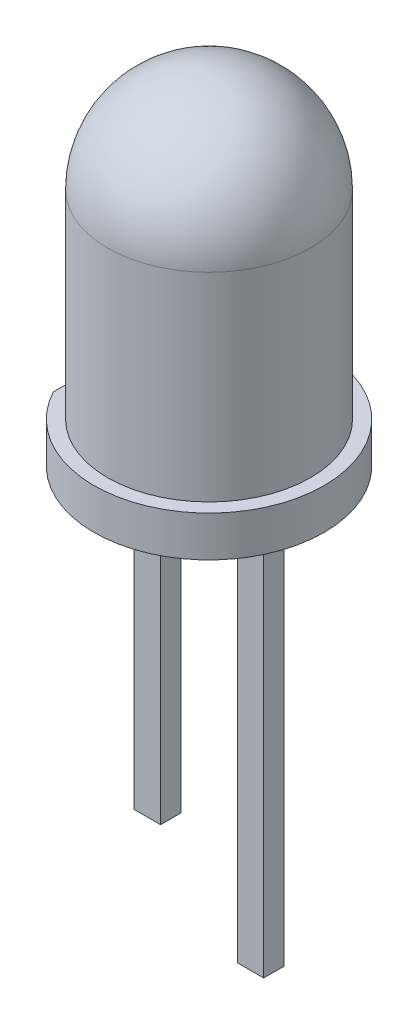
ISO-10303-21;
HEADER;
FILE_DESCRIPTION(('STEP AP214'),'2;1');
FILE_NAME('part.step','',(''),(''),'','','');
FILE_SCHEMA(('AUTOMOTIVE_DESIGN { 1 0 10303 214 1 1 1 1 }'));
ENDSEC;
DATA;
#1=APPLICATION_CONTEXT('core data for automotive mechanical design processes');
#2=APPLICATION_PROTOCOL_DEFINITION('international standard','automotive_design',2000,#1);
#3=PRODUCT_CONTEXT('',#1,'mechanical');
#4=PRODUCT('Part','Part','',(#3));
#5=PRODUCT_RELATED_PRODUCT_CATEGORY('part','',(#4));
#6=PRODUCT_DEFINITION_FORMATION('','',#4);
#7=PRODUCT_DEFINITION_CONTEXT('part definition',#1,'design');
#8=PRODUCT_DEFINITION('design','',#6,#7);
#9=PRODUCT_DEFINITION_SHAPE('','',#8);
#10=(LENGTH_UNIT() NAMED_UNIT(*) SI_UNIT(.MILLI.,.METRE.));
#11=(NAMED_UNIT(*) PLANE_ANGLE_UNIT() SI_UNIT($,.RADIAN.));
#12=(NAMED_UNIT(*) SI_UNIT($,.STERADIAN.) SOLID_ANGLE_UNIT());
#13=UNCERTAINTY_MEASURE_WITH_UNIT(LENGTH_MEASURE(1.E-05),#10,'distance_accuracy_value','');
#14=(GEOMETRIC_REPRESENTATION_CONTEXT(3) GLOBAL_UNCERTAINTY_ASSIGNED_CONTEXT((#13)) GLOBAL_UNIT_ASSIGNED_CONTEXT((#10,
#11,#12)) REPRESENTATION_CONTEXT('',''));
#15=CARTESIAN_POINT('',(0.,0.,0.));
#16=DIRECTION('',(0.,0.,1.));
#17=DIRECTION('',(1.,0.,0.));
#18=AXIS2_PLACEMENT_3D('',#15,#16,#17);
#19=CARTESIAN_POINT('',(-1.595,0.,0.25));
#20=DIRECTION('',(0.,1.,0.));
#21=DIRECTION('',(0.,0.,1.));
#22=AXIS2_PLACEMENT_3D('',#19,#20,#21);
#23=PLANE('',#22);
#24=DIRECTION('',(1.,0.,0.));
#25=VECTOR('',#24,1.);
#26=CARTESIAN_POINT('',(-1.595,0.,-0.25));
#27=LINE('',#26,#25);
#28=CARTESIAN_POINT('',(-1.595,0.,-0.25));
#29=VERTEX_POINT('',#28);
#30=CARTESIAN_POINT('',(-0.945,0.,-0.25));
#31=VERTEX_POINT('',#30);
#32=EDGE_CURVE('E87',#29,#31,#27,.T.);
#33=ORIENTED_EDGE('',*,*,#32,.T.);
#34=DIRECTION('',(0.,0.,-1.));
#35=VECTOR('',#34,1.);
#36=CARTESIAN_POINT('',(-0.945,0.,0.25));
#37=LINE('',#36,#35);
#38=CARTESIAN_POINT('',(-0.945,0.,0.25));
#39=VERTEX_POINT('',#38);
#40=EDGE_CURVE('E12',#39,#31,#37,.T.);
#41=ORIENTED_EDGE('',*,*,#40,.F.);
#42=DIRECTION('',(1.,0.,0.));
#43=VECTOR('',#42,1.);
#44=CARTESIAN_POINT('',(-1.595,0.,0.25));
#45=LINE('',#44,#43);
#46=CARTESIAN_POINT('',(-1.595,0.,0.25));
#47=VERTEX_POINT('',#46);
#48=EDGE_CURVE('E108',#47,#39,#45,.T.);
#49=ORIENTED_EDGE('',*,*,#48,.F.);
#50=DIRECTION('',(0.,0.,-1.));
#51=VECTOR('',#50,1.);
#52=CARTESIAN_POINT('',(-1.595,0.,0.25));
#53=LINE('',#52,#51);
#54=EDGE_CURVE('E100',#47,#29,#53,.T.);
#55=ORIENTED_EDGE('',*,*,#54,.T.);
#56=EDGE_LOOP('',(#33,#41,#49,#55));
#57=FACE_BOUND('',#56,.T.);
#58=ADVANCED_FACE('F37',(#57),#23,.F.);
#59=CARTESIAN_POINT('',(-0.945,0.,0.25));
#60=DIRECTION('',(-1.,0.,0.));
#61=DIRECTION('',(0.,0.,1.));
#62=AXIS2_PLACEMENT_3D('',#59,#60,#61);
#63=PLANE('',#62);
#64=DIRECTION('',(0.,1.,0.));
#65=VECTOR('',#64,1.);
#66=CARTESIAN_POINT('',(-0.945,0.,-0.25));
#67=LINE('',#66,#65);
#68=CARTESIAN_POINT('',(-0.945,0.271653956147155,-0.25));
#69=VERTEX_POINT('',#68);
#70=EDGE_CURVE('E83',#31,#69,#67,.T.);
#71=ORIENTED_EDGE('',*,*,#70,.T.);
#72=DIRECTION('',(0.,0.,-1.));
#73=VECTOR('',#72,1.);
#74=CARTESIAN_POINT('',(-0.945,0.271653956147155,0.25));
#75=LINE('',#74,#73);
#76=CARTESIAN_POINT('',(-0.945,0.271653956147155,0.25));
#77=VERTEX_POINT('',#76);
#78=EDGE_CURVE('E44',#77,#69,#75,.T.);
#79=ORIENTED_EDGE('',*,*,#78,.F.);
#80=DIRECTION('',(0.,1.,0.));
#81=VECTOR('',#80,1.);
#82=CARTESIAN_POINT('',(-0.945,0.,0.25));
#83=LINE('',#82,#81);
#84=EDGE_CURVE('E96',#39,#77,#83,.T.);
#85=ORIENTED_EDGE('',*,*,#84,.F.);
#86=ORIENTED_EDGE('',*,*,#40,.T.);
#87=EDGE_LOOP('',(#71,#79,#85,#86));
#88=FACE_BOUND('',#87,.T.);
#89=ADVANCED_FACE('F95',(#88),#63,.F.);
#90=CARTESIAN_POINT('',(-0.945,0.271653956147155,0.25));
#91=DIRECTION('',(-0.485529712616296,0.874220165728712,0.));
#92=DIRECTION('',(-0.874220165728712,-0.485529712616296,0.));
#93=AXIS2_PLACEMENT_3D('',#90,#91,#92);
#94=PLANE('',#93);
#95=DIRECTION('',(0.874220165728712,0.485529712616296,0.));
#96=VECTOR('',#95,1.);
#97=CARTESIAN_POINT('',(-0.945,0.271653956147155,-0.25));
#98=LINE('',#97,#96);
#99=CARTESIAN_POINT('',(-0.32399866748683,0.616549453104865,-0.25));
#100=VERTEX_POINT('',#99);
#101=EDGE_CURVE('E89',#69,#100,#98,.T.);
#102=ORIENTED_EDGE('',*,*,#101,.T.);
#103=DIRECTION('',(0.,0.,-1.));
#104=VECTOR('',#103,1.);
#105=CARTESIAN_POINT('',(-0.32399866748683,0.616549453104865,0.25));
#106=LINE('',#105,#104);
#107=CARTESIAN_POINT('',(-0.32399866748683,0.616549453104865,0.25));
#108=VERTEX_POINT('',#107);
#109=EDGE_CURVE('E119',#108,#100,#106,.T.);
#110=ORIENTED_EDGE('',*,*,#109,.F.);
#111=DIRECTION('',(0.874220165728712,0.485529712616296,0.));
#112=VECTOR('',#111,1.);
#113=CARTESIAN_POINT('',(-0.945,0.271653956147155,0.25));
#114=LINE('',#113,#112);
#115=EDGE_CURVE('E111',#77,#108,#114,.T.);
#116=ORIENTED_EDGE('',*,*,#115,.F.);
#117=ORIENTED_EDGE('',*,*,#78,.T.);
#118=EDGE_LOOP('',(#102,#110,#116,#117));
#119=FACE_BOUND('',#118,.T.);
#120=ADVANCED_FACE('F123',(#119),#94,.F.);
#121=CARTESIAN_POINT('',(-1.595,3.29327204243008,0.25));
#122=DIRECTION('',(-0.9033352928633,-0.428935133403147,0.));
#123=DIRECTION('',(0.428935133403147,-0.9033352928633,0.));
#124=AXIS2_PLACEMENT_3D('',#121,#122,#123);
#125=PLANE('',#124);
#126=DIRECTION('',(-0.428935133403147,0.9033352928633,0.));
#127=VECTOR('',#126,1.);
#128=CARTESIAN_POINT('',(-1.595,3.29327204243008,-0.25));
#129=LINE('',#128,#127);
#130=CARTESIAN_POINT('',(-1.595,3.29327204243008,-0.25));
#131=VERTEX_POINT('',#130);
#132=EDGE_CURVE('E104',#100,#131,#129,.T.);
#133=ORIENTED_EDGE('',*,*,#132,.T.);
#134=DIRECTION('',(0.,0.,-1.));
#135=VECTOR('',#134,1.);
#136=CARTESIAN_POINT('',(-1.595,3.29327204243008,0.25));
#137=LINE('',#136,#135);
#138=CARTESIAN_POINT('',(-1.595,3.29327204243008,0.25));
#139=VERTEX_POINT('',#138);
#140=EDGE_CURVE('E116',#139,#131,#137,.T.);
#141=ORIENTED_EDGE('',*,*,#140,.F.);
#142=DIRECTION('',(-0.428935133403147,0.9033352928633,0.));
#143=VECTOR('',#142,1.);
#144=CARTESIAN_POINT('',(-1.595,3.29327204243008,0.25));
#145=LINE('',#144,#143);
#146=EDGE_CURVE('E56',#108,#139,#145,.T.);
#147=ORIENTED_EDGE('',*,*,#146,.F.);
#148=ORIENTED_EDGE('',*,*,#109,.T.);
#149=EDGE_LOOP('',(#133,#141,#147,#148));
#150=FACE_BOUND('',#149,.T.);
#151=ADVANCED_FACE('F134',(#150),#125,.F.);
#152=CARTESIAN_POINT('',(-1.595,0.,0.25));
#153=DIRECTION('',(1.,0.,0.));
#154=DIRECTION('',(0.,0.,-1.));
#155=AXIS2_PLACEMENT_3D('',#152,#153,#154);
#156=PLANE('',#155);
#157=DIRECTION('',(0.,-1.,0.));
#158=VECTOR('',#157,1.);
#159=CARTESIAN_POINT('',(-1.595,0.,-0.25));
#160=LINE('',#159,#158);
#161=EDGE_CURVE('E106',#131,#29,#160,.T.);
#162=ORIENTED_EDGE('',*,*,#161,.T.);
#163=ORIENTED_EDGE('',*,*,#54,.F.);
#164=DIRECTION('',(0.,-1.,0.));
#165=VECTOR('',#164,1.);
#166=CARTESIAN_POINT('',(-1.595,0.,0.25));
#167=LINE('',#166,#165);
#168=EDGE_CURVE('E51',#139,#47,#167,.T.);
#169=ORIENTED_EDGE('',*,*,#168,.F.);
#170=ORIENTED_EDGE('',*,*,#140,.T.);
#171=EDGE_LOOP('',(#162,#163,#169,#170));
#172=FACE_BOUND('',#171,.T.);
#173=ADVANCED_FACE('F127',(#172),#156,.F.);
#174=CARTESIAN_POINT('',(-0.945,0.,0.25));
#175=DIRECTION('',(0.,0.,1.));
#176=DIRECTION('',(1.,0.,0.));
#177=AXIS2_PLACEMENT_3D('',#174,#175,#176);
#178=PLANE('',#177);
#179=ORIENTED_EDGE('',*,*,#48,.T.);
#180=ORIENTED_EDGE('',*,*,#84,.T.);
#181=ORIENTED_EDGE('',*,*,#115,.T.);
#182=ORIENTED_EDGE('',*,*,#146,.T.);
#183=ORIENTED_EDGE('',*,*,#168,.T.);
#184=EDGE_LOOP('',(#179,#180,#181,#182,#183));
#185=FACE_BOUND('',#184,.T.);
#186=ADVANCED_FACE('F125',(#185),#178,.T.);
#187=CARTESIAN_POINT('',(-0.945,0.,-0.25));
#188=DIRECTION('',(0.,0.,1.));
#189=DIRECTION('',(1.,0.,0.));
#190=AXIS2_PLACEMENT_3D('',#187,#188,#189);
#191=PLANE('',#190);
#192=ORIENTED_EDGE('',*,*,#32,.F.);
#193=ORIENTED_EDGE('',*,*,#161,.F.);
#194=ORIENTED_EDGE('',*,*,#132,.F.);
#195=ORIENTED_EDGE('',*,*,#101,.F.);
#196=ORIENTED_EDGE('',*,*,#70,.F.);
#197=EDGE_LOOP('',(#192,#193,#194,#195,#196));
#198=FACE_BOUND('',#197,.T.);
#199=ADVANCED_FACE('F84',(#198),#191,.F.);
#200=CLOSED_SHELL('',(#58,#89,#120,#151,#173,#186,#199));
#201=MANIFOLD_SOLID_BREP('B2',#200);
#202=CARTESIAN_POINT('',(1.595,0.,0.25));
#203=DIRECTION('',(0.,1.,0.));
#204=DIRECTION('',(0.,0.,1.));
#205=AXIS2_PLACEMENT_3D('',#202,#203,#204);
#206=PLANE('',#205);
#207=DIRECTION('',(1.,0.,0.));
#208=VECTOR('',#207,1.);
#209=CARTESIAN_POINT('',(1.595,0.,-0.25));
#210=LINE('',#209,#208);
#211=CARTESIAN_POINT('',(0.945,0.,-0.25));
#212=VERTEX_POINT('',#211);
#213=CARTESIAN_POINT('',(1.595,0.,-0.25));
#214=VERTEX_POINT('',#213);
#215=EDGE_CURVE('E255',#212,#214,#210,.T.);
#216=ORIENTED_EDGE('',*,*,#215,.T.);
#217=DIRECTION('',(0.,0.,-1.));
#218=VECTOR('',#217,1.);
#219=CARTESIAN_POINT('',(1.595,0.,0.25));
#220=LINE('',#219,#218);
#221=CARTESIAN_POINT('',(1.595,0.,0.25));
#222=VERTEX_POINT('',#221);
#223=EDGE_CURVE('E35',#222,#214,#220,.T.);
#224=ORIENTED_EDGE('',*,*,#223,.F.);
#225=DIRECTION('',(1.,0.,0.));
#226=VECTOR('',#225,1.);
#227=CARTESIAN_POINT('',(1.595,0.,0.25));
#228=LINE('',#227,#226);
#229=CARTESIAN_POINT('',(0.945,0.,0.25));
#230=VERTEX_POINT('',#229);
#231=EDGE_CURVE('E284',#230,#222,#228,.T.);
#232=ORIENTED_EDGE('',*,*,#231,.F.);
#233=DIRECTION('',(0.,0.,-1.));
#234=VECTOR('',#233,1.);
#235=CARTESIAN_POINT('',(0.945,0.,0.25));
#236=LINE('',#235,#234);
#237=EDGE_CURVE('E268',#230,#212,#236,.T.);
#238=ORIENTED_EDGE('',*,*,#237,.T.);
#239=EDGE_LOOP('',(#216,#224,#232,#238));
#240=FACE_BOUND('',#239,.T.);
#241=ADVANCED_FACE('F181',(#240),#206,.F.);
#242=CARTESIAN_POINT('',(1.595,0.,0.25));
#243=DIRECTION('',(-1.,0.,0.));
#244=DIRECTION('',(0.,-1.,0.));
#245=AXIS2_PLACEMENT_3D('',#242,#243,#244);
#246=PLANE('',#245);
#247=DIRECTION('',(0.,1.,0.));
#248=VECTOR('',#247,1.);
#249=CARTESIAN_POINT('',(1.595,0.,-0.25));
#250=LINE('',#249,#248);
#251=CARTESIAN_POINT('',(1.595,3.5,-0.25));
#252=VERTEX_POINT('',#251);
#253=EDGE_CURVE('E251',#214,#252,#250,.T.);
#254=ORIENTED_EDGE('',*,*,#253,.T.);
#255=DIRECTION('',(0.,0.,-1.));
#256=VECTOR('',#255,1.);
#257=CARTESIAN_POINT('',(1.595,3.5,0.25));
#258=LINE('',#257,#256);
#259=CARTESIAN_POINT('',(1.595,3.5,0.25));
#260=VERTEX_POINT('',#259);
#261=EDGE_CURVE('E188',#260,#252,#258,.T.);
#262=ORIENTED_EDGE('',*,*,#261,.F.);
#263=DIRECTION('',(0.,1.,0.));
#264=VECTOR('',#263,1.);
#265=CARTESIAN_POINT('',(1.595,0.,0.25));
#266=LINE('',#265,#264);
#267=EDGE_CURVE('E264',#222,#260,#266,.T.);
#268=ORIENTED_EDGE('',*,*,#267,.F.);
#269=ORIENTED_EDGE('',*,*,#223,.T.);
#270=EDGE_LOOP('',(#254,#262,#268,#269));
#271=FACE_BOUND('',#270,.T.);
#272=ADVANCED_FACE('F263',(#271),#246,.F.);
#273=CARTESIAN_POINT('',(1.595,3.5,0.25));
#274=DIRECTION('',(0.,-1.,0.));
#275=DIRECTION('',(0.,0.,-1.));
#276=AXIS2_PLACEMENT_3D('',#273,#274,#275);
#277=PLANE('',#276);
#278=DIRECTION('',(-1.,0.,0.));
#279=VECTOR('',#278,1.);
#280=CARTESIAN_POINT('',(1.595,3.5,-0.25));
#281=LINE('',#280,#279);
#282=CARTESIAN_POINT('',(0.80632764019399,3.5,-0.25));
#283=VERTEX_POINT('',#282);
#284=EDGE_CURVE('E257',#252,#283,#281,.T.);
#285=ORIENTED_EDGE('',*,*,#284,.T.);
#286=DIRECTION('',(0.,0.,-1.));
#287=VECTOR('',#286,1.);
#288=CARTESIAN_POINT('',(0.80632764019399,3.5,0.25));
#289=LINE('',#288,#287);
#290=CARTESIAN_POINT('',(0.80632764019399,3.5,0.25));
#291=VERTEX_POINT('',#290);
#292=EDGE_CURVE('E315',#291,#283,#289,.T.);
#293=ORIENTED_EDGE('',*,*,#292,.F.);
#294=DIRECTION('',(-1.,0.,0.));
#295=VECTOR('',#294,1.);
#296=CARTESIAN_POINT('',(1.595,3.5,0.25));
#297=LINE('',#296,#295);
#298=EDGE_CURVE('E287',#260,#291,#297,.T.);
#299=ORIENTED_EDGE('',*,*,#298,.F.);
#300=ORIENTED_EDGE('',*,*,#261,.T.);
#301=EDGE_LOOP('',(#285,#293,#299,#300));
#302=FACE_BOUND('',#301,.T.);
#303=ADVANCED_FACE('F319',(#302),#277,.F.);
#304=CARTESIAN_POINT('',(0.80632764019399,3.5,0.25));
#305=DIRECTION('',(0.796529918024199,-0.604599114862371,0.));
#306=DIRECTION('',(0.604599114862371,0.796529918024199,0.));
#307=AXIS2_PLACEMENT_3D('',#304,#305,#306);
#308=PLANE('',#307);
#309=DIRECTION('',(-0.604599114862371,-0.796529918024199,0.));
#310=VECTOR('',#309,1.);
#311=CARTESIAN_POINT('',(0.80632764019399,3.5,-0.25));
#312=LINE('',#311,#310);
#313=CARTESIAN_POINT('',(0.521534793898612,3.12479928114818,-0.25));
#314=VERTEX_POINT('',#313);
#315=EDGE_CURVE('E272',#283,#314,#312,.T.);
#316=ORIENTED_EDGE('',*,*,#315,.T.);
#317=DIRECTION('',(0.,0.,-1.));
#318=VECTOR('',#317,1.);
#319=CARTESIAN_POINT('',(0.521534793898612,3.12479928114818,0.25));
#320=LINE('',#319,#318);
#321=CARTESIAN_POINT('',(0.521534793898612,3.12479928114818,0.25));
#322=VERTEX_POINT('',#321);
#323=EDGE_CURVE('E312',#322,#314,#320,.T.);
#324=ORIENTED_EDGE('',*,*,#323,.F.);
#325=DIRECTION('',(-0.604599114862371,-0.796529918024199,0.));
#326=VECTOR('',#325,1.);
#327=CARTESIAN_POINT('',(0.80632764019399,3.5,0.25));
#328=LINE('',#327,#326);
#329=EDGE_CURVE('E289',#291,#322,#328,.T.);
#330=ORIENTED_EDGE('',*,*,#329,.F.);
#331=ORIENTED_EDGE('',*,*,#292,.T.);
#332=EDGE_LOOP('',(#316,#324,#330,#331));
#333=FACE_BOUND('',#332,.T.);
#334=ADVANCED_FACE('F327',(#333),#308,.F.);
#335=CARTESIAN_POINT('',(0.123269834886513,3.42709883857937,0.25));
#336=DIRECTION('',(0.,0.,-1.));
#337=DIRECTION('',(-1.,0.,0.));
#338=AXIS2_PLACEMENT_3D('',#335,#336,#337);
#339=CYLINDRICAL_SURFACE('',#338,0.5);
#340=CARTESIAN_POINT('',(0.123269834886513,3.42709883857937,-0.25));
#341=DIRECTION('',(0.,0.,-1.));
#342=DIRECTION('',(1.,0.,0.));
#343=AXIS2_PLACEMENT_3D('',#340,#341,#342);
#344=CIRCLE('',#343,0.5);
#345=CARTESIAN_POINT('',(-0.103725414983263,2.98159557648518,-0.25));
#346=VERTEX_POINT('',#345);
#347=EDGE_CURVE('E274',#314,#346,#344,.T.);
#348=ORIENTED_EDGE('',*,*,#347,.T.);
#349=DIRECTION('',(0.,0.,-1.));
#350=VECTOR('',#349,1.);
#351=CARTESIAN_POINT('',(-0.103725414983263,2.98159557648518,0.25));
#352=LINE('',#351,#350);
#353=CARTESIAN_POINT('',(-0.103725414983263,2.98159557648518,0.25));
#354=VERTEX_POINT('',#353);
#355=EDGE_CURVE('E309',#354,#346,#352,.T.);
#356=ORIENTED_EDGE('',*,*,#355,.F.);
#357=CARTESIAN_POINT('',(0.123269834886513,3.42709883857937,0.25));
#358=DIRECTION('',(0.,0.,-1.));
#359=DIRECTION('',(1.,0.,0.));
#360=AXIS2_PLACEMENT_3D('',#357,#358,#359);
#361=CIRCLE('',#360,0.5);
#362=EDGE_CURVE('E291',#322,#354,#361,.T.);
#363=ORIENTED_EDGE('',*,*,#362,.F.);
#364=ORIENTED_EDGE('',*,*,#323,.T.);
#365=EDGE_LOOP('',(#348,#356,#363,#364));
#366=FACE_BOUND('',#365,.T.);
#367=ADVANCED_FACE('F330',(#366),#339,.F.);
#368=CARTESIAN_POINT('',(-1.29298369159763,3.58755293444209,0.25));
#369=DIRECTION('',(-0.453990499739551,-0.891006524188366,0.));
#370=DIRECTION('',(0.891006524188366,-0.453990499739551,0.));
#371=AXIS2_PLACEMENT_3D('',#368,#369,#370);
#372=PLANE('',#371);
#373=DIRECTION('',(-0.891006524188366,0.453990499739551,0.));
#374=VECTOR('',#373,1.);
#375=CARTESIAN_POINT('',(-1.29298369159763,3.58755293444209,-0.25));
#376=LINE('',#375,#374);
#377=CARTESIAN_POINT('',(-1.29298369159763,3.58755293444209,-0.25));
#378=VERTEX_POINT('',#377);
#379=EDGE_CURVE('E276',#346,#378,#376,.T.);
#380=ORIENTED_EDGE('',*,*,#379,.T.);
#381=DIRECTION('',(0.,0.,-1.));
#382=VECTOR('',#381,1.);
#383=CARTESIAN_POINT('',(-1.29298369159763,3.58755293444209,0.25));
#384=LINE('',#383,#382);
#385=CARTESIAN_POINT('',(-1.29298369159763,3.58755293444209,0.25));
#386=VERTEX_POINT('',#385);
#387=EDGE_CURVE('E306',#386,#378,#384,.T.);
#388=ORIENTED_EDGE('',*,*,#387,.F.);
#389=DIRECTION('',(-0.891006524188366,0.453990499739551,0.));
#390=VECTOR('',#389,1.);
#391=CARTESIAN_POINT('',(-1.29298369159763,3.58755293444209,0.25));
#392=LINE('',#391,#390);
#393=EDGE_CURVE('E293',#354,#386,#392,.T.);
#394=ORIENTED_EDGE('',*,*,#393,.F.);
#395=ORIENTED_EDGE('',*,*,#355,.T.);
#396=EDGE_LOOP('',(#380,#388,#394,#395));
#397=FACE_BOUND('',#396,.T.);
#398=ADVANCED_FACE('F335',(#397),#372,.F.);
#399=CARTESIAN_POINT('',(0.231099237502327,0.377841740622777,0.25));
#400=DIRECTION('',(0.9033352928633,0.428935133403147,0.));
#401=DIRECTION('',(-0.428935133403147,0.9033352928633,0.));
#402=AXIS2_PLACEMENT_3D('',#399,#400,#401);
#403=PLANE('',#402);
#404=DIRECTION('',(0.428935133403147,-0.9033352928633,0.));
#405=VECTOR('',#404,1.);
#406=CARTESIAN_POINT('',(0.231099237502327,0.377841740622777,-0.25));
#407=LINE('',#406,#405);
#408=CARTESIAN_POINT('',(0.231099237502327,0.377841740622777,-0.25));
#409=VERTEX_POINT('',#408);
#410=EDGE_CURVE('E278',#378,#409,#407,.T.);
#411=ORIENTED_EDGE('',*,*,#410,.T.);
#412=DIRECTION('',(0.,0.,-1.));
#413=VECTOR('',#412,1.);
#414=CARTESIAN_POINT('',(0.231099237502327,0.377841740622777,0.25));
#415=LINE('',#414,#413);
#416=CARTESIAN_POINT('',(0.231099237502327,0.377841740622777,0.25));
#417=VERTEX_POINT('',#416);
#418=EDGE_CURVE('E303',#417,#409,#415,.T.);
#419=ORIENTED_EDGE('',*,*,#418,.F.);
#420=DIRECTION('',(0.428935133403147,-0.9033352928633,0.));
#421=VECTOR('',#420,1.);
#422=CARTESIAN_POINT('',(0.231099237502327,0.377841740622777,0.25));
#423=LINE('',#422,#421);
#424=EDGE_CURVE('E295',#386,#417,#423,.T.);
#425=ORIENTED_EDGE('',*,*,#424,.F.);
#426=ORIENTED_EDGE('',*,*,#387,.T.);
#427=EDGE_LOOP('',(#411,#419,#425,#426));
#428=FACE_BOUND('',#427,.T.);
#429=ADVANCED_FACE('F339',(#428),#403,.F.);
#430=CARTESIAN_POINT('',(0.945,0.23,0.25));
#431=DIRECTION('',(0.202787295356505,0.979222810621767,0.));
#432=DIRECTION('',(-0.979222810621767,0.202787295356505,0.));
#433=AXIS2_PLACEMENT_3D('',#430,#431,#432);
#434=PLANE('',#433);
#435=DIRECTION('',(0.979222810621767,-0.202787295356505,0.));
#436=VECTOR('',#435,1.);
#437=CARTESIAN_POINT('',(0.945,0.23,-0.25));
#438=LINE('',#437,#436);
#439=CARTESIAN_POINT('',(0.945,0.23,-0.25));
#440=VERTEX_POINT('',#439);
#441=EDGE_CURVE('E280',#409,#440,#438,.T.);
#442=ORIENTED_EDGE('',*,*,#441,.T.);
#443=DIRECTION('',(0.,0.,-1.));
#444=VECTOR('',#443,1.);
#445=CARTESIAN_POINT('',(0.945,0.23,0.25));
#446=LINE('',#445,#444);
#447=CARTESIAN_POINT('',(0.945,0.23,0.25));
#448=VERTEX_POINT('',#447);
#449=EDGE_CURVE('E300',#448,#440,#446,.T.);
#450=ORIENTED_EDGE('',*,*,#449,.F.);
#451=DIRECTION('',(0.979222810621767,-0.202787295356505,0.));
#452=VECTOR('',#451,1.);
#453=CARTESIAN_POINT('',(0.945,0.23,0.25));
#454=LINE('',#453,#452);
#455=EDGE_CURVE('E200',#417,#448,#454,.T.);
#456=ORIENTED_EDGE('',*,*,#455,.F.);
#457=ORIENTED_EDGE('',*,*,#418,.T.);
#458=EDGE_LOOP('',(#442,#450,#456,#457));
#459=FACE_BOUND('',#458,.T.);
#460=ADVANCED_FACE('F343',(#459),#434,.F.);
#461=CARTESIAN_POINT('',(0.945,0.,0.25));
#462=DIRECTION('',(1.,0.,0.));
#463=DIRECTION('',(0.,0.,-1.));
#464=AXIS2_PLACEMENT_3D('',#461,#462,#463);
#465=PLANE('',#464);
#466=DIRECTION('',(0.,-1.,0.));
#467=VECTOR('',#466,1.);
#468=CARTESIAN_POINT('',(0.945,0.,-0.25));
#469=LINE('',#468,#467);
#470=EDGE_CURVE('E282',#440,#212,#469,.T.);
#471=ORIENTED_EDGE('',*,*,#470,.T.);
#472=ORIENTED_EDGE('',*,*,#237,.F.);
#473=DIRECTION('',(0.,-1.,0.));
#474=VECTOR('',#473,1.);
#475=CARTESIAN_POINT('',(0.945,0.,0.25));
#476=LINE('',#475,#474);
#477=EDGE_CURVE('E195',#448,#230,#476,.T.);
#478=ORIENTED_EDGE('',*,*,#477,.F.);
#479=ORIENTED_EDGE('',*,*,#449,.T.);
#480=EDGE_LOOP('',(#471,#472,#478,#479));
#481=FACE_BOUND('',#480,.T.);
#482=ADVANCED_FACE('F345',(#481),#465,.F.);
#483=CARTESIAN_POINT('',(0.123269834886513,3.42709883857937,0.25));
#484=DIRECTION('',(0.,0.,1.));
#485=DIRECTION('',(1.,0.,0.));
#486=AXIS2_PLACEMENT_3D('',#483,#484,#485);
#487=PLANE('',#486);
#488=ORIENTED_EDGE('',*,*,#231,.T.);
#489=ORIENTED_EDGE('',*,*,#267,.T.);
#490=ORIENTED_EDGE('',*,*,#298,.T.);
#491=ORIENTED_EDGE('',*,*,#329,.T.);
#492=ORIENTED_EDGE('',*,*,#362,.T.);
#493=ORIENTED_EDGE('',*,*,#393,.T.);
#494=ORIENTED_EDGE('',*,*,#424,.T.);
#495=ORIENTED_EDGE('',*,*,#455,.T.);
#496=ORIENTED_EDGE('',*,*,#477,.T.);
#497=EDGE_LOOP('',(#488,#489,#490,#491,#492,#493,#494,#495,#496));
#498=FACE_BOUND('',#497,.T.);
#499=ADVANCED_FACE('F322',(#498),#487,.T.);
#500=CARTESIAN_POINT('',(0.123269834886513,3.42709883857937,-0.25));
#501=DIRECTION('',(0.,0.,1.));
#502=DIRECTION('',(1.,0.,0.));
#503=AXIS2_PLACEMENT_3D('',#500,#501,#502);
#504=PLANE('',#503);
#505=ORIENTED_EDGE('',*,*,#215,.F.);
#506=ORIENTED_EDGE('',*,*,#470,.F.);
#507=ORIENTED_EDGE('',*,*,#441,.F.);
#508=ORIENTED_EDGE('',*,*,#410,.F.);
#509=ORIENTED_EDGE('',*,*,#379,.F.);
#510=ORIENTED_EDGE('',*,*,#347,.F.);
#511=ORIENTED_EDGE('',*,*,#315,.F.);
#512=ORIENTED_EDGE('',*,*,#284,.F.);
#513=ORIENTED_EDGE('',*,*,#253,.F.);
#514=EDGE_LOOP('',(#505,#506,#507,#508,#509,#510,#511,#512,#513));
#515=FACE_BOUND('',#514,.T.);
#516=ADVANCED_FACE('F252',(#515),#504,.F.);
#517=CLOSED_SHELL('',(#241,#272,#303,#334,#367,#398,#429,#460,#482,#499,#516));
#518=MANIFOLD_SOLID_BREP('B6',#517);
#519=CARTESIAN_POINT('',(-2.835,0.,0.));
#520=DIRECTION('',(0.,1.,0.));
#521=DIRECTION('',(0.,0.,1.));
#522=AXIS2_PLACEMENT_3D('',#519,#520,#521);
#523=PLANE('',#522);
#524=DIRECTION('',(-1.,0.,0.));
#525=VECTOR('',#524,1.);
#526=CARTESIAN_POINT('',(-0.945,0.,0.25));
#527=LINE('',#526,#525);
#528=CARTESIAN_POINT('',(-0.945,0.,0.25));
#529=VERTEX_POINT('',#528);
#530=CARTESIAN_POINT('',(-1.595,0.,0.25));
#531=VERTEX_POINT('',#530);
#532=EDGE_CURVE('E588',#529,#531,#527,.T.);
#533=ORIENTED_EDGE('',*,*,#532,.F.);
#534=DIRECTION('',(0.,0.,1.));
#535=VECTOR('',#534,1.);
#536=CARTESIAN_POINT('',(-0.945,0.,0.25));
#537=LINE('',#536,#535);
#538=CARTESIAN_POINT('',(-0.945,0.,-0.25));
#539=VERTEX_POINT('',#538);
#540=EDGE_CURVE('E509',#539,#529,#537,.T.);
#541=ORIENTED_EDGE('',*,*,#540,.F.);
#542=DIRECTION('',(1.,0.,0.));
#543=VECTOR('',#542,1.);
#544=CARTESIAN_POINT('',(-0.945,0.,-0.25));
#545=LINE('',#544,#543);
#546=CARTESIAN_POINT('',(-1.595,0.,-0.25));
#547=VERTEX_POINT('',#546);
#548=EDGE_CURVE('E514',#547,#539,#545,.T.);
#549=ORIENTED_EDGE('',*,*,#548,.F.);
#550=DIRECTION('',(0.,0.,-1.));
#551=VECTOR('',#550,1.);
#552=CARTESIAN_POINT('',(-1.595,0.,0.25));
#553=LINE('',#552,#551);
#554=EDGE_CURVE('E590',#531,#547,#553,.T.);
#555=ORIENTED_EDGE('',*,*,#554,.F.);
#556=EDGE_LOOP('',(#533,#541,#549,#555));
#557=FACE_BOUND('',#556,.T.);
#558=CARTESIAN_POINT('',(0.,0.,0.));
#559=DIRECTION('',(0.,-1.,0.));
#560=DIRECTION('',(0.,0.,-1.));
#561=AXIS2_PLACEMENT_3D('',#558,#559,#560);
#562=CIRCLE('',#561,2.835);
#563=CARTESIAN_POINT('',(-2.5,0.,-1.33687134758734));
#564=VERTEX_POINT('',#563);
#565=CARTESIAN_POINT('',(-2.5,0.,1.33687134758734));
#566=VERTEX_POINT('',#565);
#567=EDGE_CURVE('E179',#564,#566,#562,.T.);
#568=ORIENTED_EDGE('',*,*,#567,.T.);
#569=DIRECTION('',(0.,0.,1.));
#570=VECTOR('',#569,1.);
#571=CARTESIAN_POINT('',(-2.5,0.,-5.));
#572=LINE('',#571,#570);
#573=EDGE_CURVE('E521',#564,#566,#572,.T.);
#574=ORIENTED_EDGE('',*,*,#573,.F.);
#575=EDGE_LOOP('',(#568,#574));
#576=FACE_BOUND('',#575,.T.);
#577=DIRECTION('',(0.,0.,-1.));
#578=VECTOR('',#577,1.);
#579=CARTESIAN_POINT('',(0.945,0.,0.25));
#580=LINE('',#579,#578);
#581=CARTESIAN_POINT('',(0.945,0.,0.25));
#582=VERTEX_POINT('',#581);
#583=CARTESIAN_POINT('',(0.945,0.,-0.25));
#584=VERTEX_POINT('',#583);
#585=EDGE_CURVE('E553',#582,#584,#580,.T.);
#586=ORIENTED_EDGE('',*,*,#585,.F.);
#587=DIRECTION('',(-1.,0.,0.));
#588=VECTOR('',#587,1.);
#589=CARTESIAN_POINT('',(0.945,0.,0.25));
#590=LINE('',#589,#588);
#591=CARTESIAN_POINT('',(1.595,0.,0.25));
#592=VERTEX_POINT('',#591);
#593=EDGE_CURVE('E555',#592,#582,#590,.T.);
#594=ORIENTED_EDGE('',*,*,#593,.F.);
#595=DIRECTION('',(0.,0.,1.));
#596=VECTOR('',#595,1.);
#597=CARTESIAN_POINT('',(1.595,0.,0.25));
#598=LINE('',#597,#596);
#599=CARTESIAN_POINT('',(1.595,0.,-0.25));
#600=VERTEX_POINT('',#599);
#601=EDGE_CURVE('E572',#600,#592,#598,.T.);
#602=ORIENTED_EDGE('',*,*,#601,.F.);
#603=DIRECTION('',(1.,0.,0.));
#604=VECTOR('',#603,1.);
#605=CARTESIAN_POINT('',(0.945,0.,-0.25));
#606=LINE('',#605,#604);
#607=EDGE_CURVE('E435',#584,#600,#606,.T.);
#608=ORIENTED_EDGE('',*,*,#607,.F.);
#609=EDGE_LOOP('',(#586,#594,#602,#608));
#610=FACE_BOUND('',#609,.T.);
#611=ADVANCED_FACE('F412',(#557,#576,#610),#523,.F.);
#612=CARTESIAN_POINT('',(0.,5.9,0.));
#613=DIRECTION('',(0.,-1.,0.));
#614=DIRECTION('',(1.,0.,0.));
#615=AXIS2_PLACEMENT_3D('',#612,#613,#614);
#616=SPHERICAL_SURFACE('',#615,2.5);
#617=CARTESIAN_POINT('',(0.,5.9,0.));
#618=DIRECTION('',(0.,-1.,0.));
#619=DIRECTION('',(0.,0.,-1.));
#620=AXIS2_PLACEMENT_3D('',#617,#618,#619);
#621=CIRCLE('',#620,2.5);
#622=CARTESIAN_POINT('',(0.,5.9,-2.5));
#623=VERTEX_POINT('',#622);
#624=EDGE_CURVE('E532',#623,#623,#621,.T.);
#625=ORIENTED_EDGE('',*,*,#624,.F.);
#626=EDGE_LOOP('',(#625));
#627=FACE_BOUND('',#626,.T.);
#628=ADVANCED_FACE('F414',(#627),#616,.T.);
#629=CARTESIAN_POINT('',(0.,0.,0.));
#630=DIRECTION('',(0.,-1.,0.));
#631=DIRECTION('',(0.,0.,-1.));
#632=AXIS2_PLACEMENT_3D('',#629,#630,#631);
#633=CYLINDRICAL_SURFACE('',#632,2.835);
#634=CARTESIAN_POINT('',(0.,1.,0.));
#635=DIRECTION('',(0.,-1.,0.));
#636=DIRECTION('',(0.,0.,-1.));
#637=AXIS2_PLACEMENT_3D('',#634,#635,#636);
#638=CIRCLE('',#637,2.835);
#639=CARTESIAN_POINT('',(-2.5,1.,-1.33687134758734));
#640=VERTEX_POINT('',#639);
#641=CARTESIAN_POINT('',(-2.5,1.,1.33687134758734));
#642=VERTEX_POINT('',#641);
#643=EDGE_CURVE('E420',#640,#642,#638,.T.);
#644=ORIENTED_EDGE('',*,*,#643,.T.);
#645=DIRECTION('',(0.,-1.,0.));
#646=VECTOR('',#645,1.);
#647=CARTESIAN_POINT('',(-2.5,0.,1.33687134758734));
#648=LINE('',#647,#646);
#649=EDGE_CURVE('E529',#642,#566,#648,.T.);
#650=ORIENTED_EDGE('',*,*,#649,.T.);
#651=ORIENTED_EDGE('',*,*,#567,.F.);
#652=DIRECTION('',(0.,-1.,0.));
#653=VECTOR('',#652,1.);
#654=CARTESIAN_POINT('',(-2.5,0.,-1.33687134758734));
#655=LINE('',#654,#653);
#656=EDGE_CURVE('E523',#564,#640,#655,.F.);
#657=ORIENTED_EDGE('',*,*,#656,.T.);
#658=EDGE_LOOP('',(#644,#650,#651,#657));
#659=FACE_BOUND('',#658,.T.);
#660=ADVANCED_FACE('F540',(#659),#633,.T.);
#661=CARTESIAN_POINT('',(-2.5,1.,0.));
#662=DIRECTION('',(0.,-1.,0.));
#663=DIRECTION('',(0.,0.,-1.));
#664=AXIS2_PLACEMENT_3D('',#661,#662,#663);
#665=PLANE('',#664);
#666=ORIENTED_EDGE('',*,*,#643,.F.);
#667=DIRECTION('',(0.,0.,1.));
#668=VECTOR('',#667,1.);
#669=CARTESIAN_POINT('',(-2.5,1.,-5.));
#670=LINE('',#669,#668);
#671=CARTESIAN_POINT('',(-2.5,1.,0.));
#672=VERTEX_POINT('',#671);
#673=EDGE_CURVE('E524',#640,#672,#670,.T.);
#674=ORIENTED_EDGE('',*,*,#673,.T.);
#675=CARTESIAN_POINT('',(0.,1.,0.));
#676=DIRECTION('',(0.,-1.,0.));
#677=DIRECTION('',(0.,0.,-1.));
#678=AXIS2_PLACEMENT_3D('',#675,#676,#677);
#679=CIRCLE('',#678,2.5);
#680=EDGE_CURVE('E535',#672,#672,#679,.T.);
#681=ORIENTED_EDGE('',*,*,#680,.T.);
#682=EDGE_CURVE('E520',#672,#642,#670,.T.);
#683=ORIENTED_EDGE('',*,*,#682,.T.);
#684=EDGE_LOOP('',(#666,#674,#681,#683));
#685=FACE_BOUND('',#684,.T.);
#686=ADVANCED_FACE('F544',(#685),#665,.F.);
#687=CARTESIAN_POINT('',(0.,0.,0.));
#688=DIRECTION('',(0.,-1.,0.));
#689=DIRECTION('',(0.,0.,-1.));
#690=AXIS2_PLACEMENT_3D('',#687,#688,#689);
#691=CYLINDRICAL_SURFACE('',#690,2.5);
#692=ORIENTED_EDGE('',*,*,#680,.F.);
#693=EDGE_LOOP('',(#692));
#694=FACE_BOUND('',#693,.T.);
#695=ORIENTED_EDGE('',*,*,#624,.T.);
#696=EDGE_LOOP('',(#695));
#697=FACE_BOUND('',#696,.T.);
#698=ADVANCED_FACE('F635',(#694,#697),#691,.T.);
#699=CARTESIAN_POINT('',(-2.5,1.,-5.));
#700=DIRECTION('',(1.,0.,0.));
#701=DIRECTION('',(0.,0.,-1.));
#702=AXIS2_PLACEMENT_3D('',#699,#700,#701);
#703=PLANE('',#702);
#704=ORIENTED_EDGE('',*,*,#682,.F.);
#705=ORIENTED_EDGE('',*,*,#673,.F.);
#706=ORIENTED_EDGE('',*,*,#656,.F.);
#707=ORIENTED_EDGE('',*,*,#573,.T.);
#708=ORIENTED_EDGE('',*,*,#649,.F.);
#709=EDGE_LOOP('',(#704,#705,#706,#707,#708));
#710=FACE_BOUND('',#709,.T.);
#711=ADVANCED_FACE('F547',(#710),#703,.F.);
#712=CARTESIAN_POINT('',(-0.945,-10.,0.25));
#713=DIRECTION('',(0.,0.,-1.));
#714=DIRECTION('',(-1.,0.,0.));
#715=AXIS2_PLACEMENT_3D('',#712,#713,#714);
#716=PLANE('',#715);
#717=DIRECTION('',(0.,1.,0.));
#718=VECTOR('',#717,1.);
#719=CARTESIAN_POINT('',(-1.595,-10.,0.25));
#720=LINE('',#719,#718);
#721=CARTESIAN_POINT('',(-1.595,-8.,0.25));
#722=VERTEX_POINT('',#721);
#723=EDGE_CURVE('E504',#722,#531,#720,.T.);
#724=ORIENTED_EDGE('',*,*,#723,.F.);
#725=DIRECTION('',(-1.,0.,0.));
#726=VECTOR('',#725,1.);
#727=CARTESIAN_POINT('',(-0.945,-8.,0.25));
#728=LINE('',#727,#726);
#729=CARTESIAN_POINT('',(-0.945,-8.,0.25));
#730=VERTEX_POINT('',#729);
#731=EDGE_CURVE('E492',#730,#722,#728,.T.);
#732=ORIENTED_EDGE('',*,*,#731,.F.);
#733=DIRECTION('',(0.,1.,0.));
#734=VECTOR('',#733,1.);
#735=CARTESIAN_POINT('',(-0.945,-10.,0.25));
#736=LINE('',#735,#734);
#737=EDGE_CURVE('E502',#730,#529,#736,.T.);
#738=ORIENTED_EDGE('',*,*,#737,.T.);
#739=ORIENTED_EDGE('',*,*,#532,.T.);
#740=EDGE_LOOP('',(#724,#732,#738,#739));
#741=FACE_BOUND('',#740,.T.);
#742=ADVANCED_FACE('F500',(#741),#716,.F.);
#743=CARTESIAN_POINT('',(-1.595,-10.,0.25));
#744=DIRECTION('',(1.,0.,0.));
#745=DIRECTION('',(0.,0.,-1.));
#746=AXIS2_PLACEMENT_3D('',#743,#744,#745);
#747=PLANE('',#746);
#748=DIRECTION('',(0.,1.,0.));
#749=VECTOR('',#748,1.);
#750=CARTESIAN_POINT('',(-1.595,-10.,-0.25));
#751=LINE('',#750,#749);
#752=CARTESIAN_POINT('',(-1.595,-8.,-0.25));
#753=VERTEX_POINT('',#752);
#754=EDGE_CURVE('E512',#753,#547,#751,.T.);
#755=ORIENTED_EDGE('',*,*,#754,.F.);
#756=DIRECTION('',(0.,0.,1.));
#757=VECTOR('',#756,1.);
#758=CARTESIAN_POINT('',(-1.595,-8.,0.25));
#759=LINE('',#758,#757);
#760=EDGE_CURVE('E560',#753,#722,#759,.T.);
#761=ORIENTED_EDGE('',*,*,#760,.T.);
#762=ORIENTED_EDGE('',*,*,#723,.T.);
#763=ORIENTED_EDGE('',*,*,#554,.T.);
#764=EDGE_LOOP('',(#755,#761,#762,#763));
#765=FACE_BOUND('',#764,.T.);
#766=ADVANCED_FACE('F599',(#765),#747,.F.);
#767=CARTESIAN_POINT('',(-0.945,-10.,-0.25));
#768=DIRECTION('',(0.,0.,1.));
#769=DIRECTION('',(1.,0.,0.));
#770=AXIS2_PLACEMENT_3D('',#767,#768,#769);
#771=PLANE('',#770);
#772=DIRECTION('',(0.,1.,0.));
#773=VECTOR('',#772,1.);
#774=CARTESIAN_POINT('',(-0.945,-10.,-0.25));
#775=LINE('',#774,#773);
#776=CARTESIAN_POINT('',(-0.945,-8.,-0.25));
#777=VERTEX_POINT('',#776);
#778=EDGE_CURVE('E510',#777,#539,#775,.T.);
#779=ORIENTED_EDGE('',*,*,#778,.F.);
#780=DIRECTION('',(-1.,0.,0.));
#781=VECTOR('',#780,1.);
#782=CARTESIAN_POINT('',(-0.945,-8.,-0.25));
#783=LINE('',#782,#781);
#784=EDGE_CURVE('E427',#777,#753,#783,.T.);
#785=ORIENTED_EDGE('',*,*,#784,.T.);
#786=ORIENTED_EDGE('',*,*,#754,.T.);
#787=ORIENTED_EDGE('',*,*,#548,.T.);
#788=EDGE_LOOP('',(#779,#785,#786,#787));
#789=FACE_BOUND('',#788,.T.);
#790=ADVANCED_FACE('F595',(#789),#771,.F.);
#791=CARTESIAN_POINT('',(-0.945,-10.,0.25));
#792=DIRECTION('',(-1.,0.,0.));
#793=DIRECTION('',(0.,0.,1.));
#794=AXIS2_PLACEMENT_3D('',#791,#792,#793);
#795=PLANE('',#794);
#796=ORIENTED_EDGE('',*,*,#737,.F.);
#797=DIRECTION('',(0.,0.,1.));
#798=VECTOR('',#797,1.);
#799=CARTESIAN_POINT('',(-0.945,-8.,-2.835));
#800=LINE('',#799,#798);
#801=EDGE_CURVE('E489',#777,#730,#800,.T.);
#802=ORIENTED_EDGE('',*,*,#801,.F.);
#803=ORIENTED_EDGE('',*,*,#778,.T.);
#804=ORIENTED_EDGE('',*,*,#540,.T.);
#805=EDGE_LOOP('',(#796,#802,#803,#804));
#806=FACE_BOUND('',#805,.T.);
#807=ADVANCED_FACE('F507',(#806),#795,.F.);
#808=CARTESIAN_POINT('',(0.945,-10.,0.25));
#809=DIRECTION('',(1.,0.,0.));
#810=DIRECTION('',(0.,0.,-1.));
#811=AXIS2_PLACEMENT_3D('',#808,#809,#810);
#812=PLANE('',#811);
#813=ORIENTED_EDGE('',*,*,#585,.T.);
#814=DIRECTION('',(0.,1.,0.));
#815=VECTOR('',#814,1.);
#816=CARTESIAN_POINT('',(0.945,-10.,-0.25));
#817=LINE('',#816,#815);
#818=CARTESIAN_POINT('',(0.945,-10.,-0.25));
#819=VERTEX_POINT('',#818);
#820=EDGE_CURVE('E586',#819,#584,#817,.T.);
#821=ORIENTED_EDGE('',*,*,#820,.F.);
#822=DIRECTION('',(0.,0.,-1.));
#823=VECTOR('',#822,1.);
#824=CARTESIAN_POINT('',(0.945,-10.,0.25));
#825=LINE('',#824,#823);
#826=CARTESIAN_POINT('',(0.945,-10.,0.25));
#827=VERTEX_POINT('',#826);
#828=EDGE_CURVE('E571',#827,#819,#825,.T.);
#829=ORIENTED_EDGE('',*,*,#828,.F.);
#830=DIRECTION('',(0.,1.,0.));
#831=VECTOR('',#830,1.);
#832=CARTESIAN_POINT('',(0.945,-10.,0.25));
#833=LINE('',#832,#831);
#834=EDGE_CURVE('E567',#827,#582,#833,.T.);
#835=ORIENTED_EDGE('',*,*,#834,.T.);
#836=EDGE_LOOP('',(#813,#821,#829,#835));
#837=FACE_BOUND('',#836,.T.);
#838=ADVANCED_FACE('F574',(#837),#812,.F.);
#839=CARTESIAN_POINT('',(0.945,-10.,-0.25));
#840=DIRECTION('',(0.,0.,1.));
#841=DIRECTION('',(1.,0.,0.));
#842=AXIS2_PLACEMENT_3D('',#839,#840,#841);
#843=PLANE('',#842);
#844=ORIENTED_EDGE('',*,*,#607,.T.);
#845=DIRECTION('',(0.,1.,0.));
#846=VECTOR('',#845,1.);
#847=CARTESIAN_POINT('',(1.595,-10.,-0.25));
#848=LINE('',#847,#846);
#849=CARTESIAN_POINT('',(1.595,-10.,-0.25));
#850=VERTEX_POINT('',#849);
#851=EDGE_CURVE('E578',#850,#600,#848,.T.);
#852=ORIENTED_EDGE('',*,*,#851,.F.);
#853=DIRECTION('',(1.,0.,0.));
#854=VECTOR('',#853,1.);
#855=CARTESIAN_POINT('',(0.945,-10.,-0.25));
#856=LINE('',#855,#854);
#857=EDGE_CURVE('E606',#819,#850,#856,.T.);
#858=ORIENTED_EDGE('',*,*,#857,.F.);
#859=ORIENTED_EDGE('',*,*,#820,.T.);
#860=EDGE_LOOP('',(#844,#852,#858,#859));
#861=FACE_BOUND('',#860,.T.);
#862=ADVANCED_FACE('F614',(#861),#843,.F.);
#863=CARTESIAN_POINT('',(1.595,-10.,0.25));
#864=DIRECTION('',(-1.,0.,0.));
#865=DIRECTION('',(0.,0.,1.));
#866=AXIS2_PLACEMENT_3D('',#863,#864,#865);
#867=PLANE('',#866);
#868=ORIENTED_EDGE('',*,*,#601,.T.);
#869=DIRECTION('',(0.,1.,0.));
#870=VECTOR('',#869,1.);
#871=CARTESIAN_POINT('',(1.595,-10.,0.25));
#872=LINE('',#871,#870);
#873=CARTESIAN_POINT('',(1.595,-10.,0.25));
#874=VERTEX_POINT('',#873);
#875=EDGE_CURVE('E570',#874,#592,#872,.T.);
#876=ORIENTED_EDGE('',*,*,#875,.F.);
#877=DIRECTION('',(0.,0.,1.));
#878=VECTOR('',#877,1.);
#879=CARTESIAN_POINT('',(1.595,-10.,0.25));
#880=LINE('',#879,#878);
#881=EDGE_CURVE('E580',#850,#874,#880,.T.);
#882=ORIENTED_EDGE('',*,*,#881,.F.);
#883=ORIENTED_EDGE('',*,*,#851,.T.);
#884=EDGE_LOOP('',(#868,#876,#882,#883));
#885=FACE_BOUND('',#884,.T.);
#886=ADVANCED_FACE('F612',(#885),#867,.F.);
#887=CARTESIAN_POINT('',(0.945,-10.,0.25));
#888=DIRECTION('',(0.,0.,-1.));
#889=DIRECTION('',(-1.,0.,0.));
#890=AXIS2_PLACEMENT_3D('',#887,#888,#889);
#891=PLANE('',#890);
#892=ORIENTED_EDGE('',*,*,#593,.T.);
#893=ORIENTED_EDGE('',*,*,#834,.F.);
#894=DIRECTION('',(-1.,0.,0.));
#895=VECTOR('',#894,1.);
#896=CARTESIAN_POINT('',(0.945,-10.,0.25));
#897=LINE('',#896,#895);
#898=EDGE_CURVE('E576',#874,#827,#897,.T.);
#899=ORIENTED_EDGE('',*,*,#898,.F.);
#900=ORIENTED_EDGE('',*,*,#875,.T.);
#901=EDGE_LOOP('',(#892,#893,#899,#900));
#902=FACE_BOUND('',#901,.T.);
#903=ADVANCED_FACE('F565',(#902),#891,.F.);
#904=CARTESIAN_POINT('',(0.945,-10.,-0.25));
#905=DIRECTION('',(0.,-1.,0.));
#906=DIRECTION('',(0.,0.,-1.));
#907=AXIS2_PLACEMENT_3D('',#904,#905,#906);
#908=PLANE('',#907);
#909=ORIENTED_EDGE('',*,*,#828,.T.);
#910=ORIENTED_EDGE('',*,*,#857,.T.);
#911=ORIENTED_EDGE('',*,*,#881,.T.);
#912=ORIENTED_EDGE('',*,*,#898,.T.);
#913=EDGE_LOOP('',(#909,#910,#911,#912));
#914=FACE_BOUND('',#913,.T.);
#915=ADVANCED_FACE('F609',(#914),#908,.T.);
#916=CARTESIAN_POINT('',(-0.945,-8.,-2.835));
#917=DIRECTION('',(0.,1.,0.));
#918=DIRECTION('',(0.,0.,1.));
#919=AXIS2_PLACEMENT_3D('',#916,#917,#918);
#920=PLANE('',#919);
#921=ORIENTED_EDGE('',*,*,#784,.F.);
#922=ORIENTED_EDGE('',*,*,#801,.T.);
#923=ORIENTED_EDGE('',*,*,#731,.T.);
#924=ORIENTED_EDGE('',*,*,#760,.F.);
#925=EDGE_LOOP('',(#921,#922,#923,#924));
#926=FACE_BOUND('',#925,.T.);
#927=ADVANCED_FACE('F491',(#926),#920,.F.);
#928=CLOSED_SHELL('',(#611,#628,#660,#686,#698,#711,#742,#766,#790,#807,#838,#862,#886,#903,
#915,#927));
#929=MANIFOLD_SOLID_BREP('B29',#928);
#930=ADVANCED_BREP_SHAPE_REPRESENTATION('',(#18,#201,#518,#929),#14);
#931=SHAPE_DEFINITION_REPRESENTATION(#9,#930);
ENDSEC;
END-ISO-10303-21;
